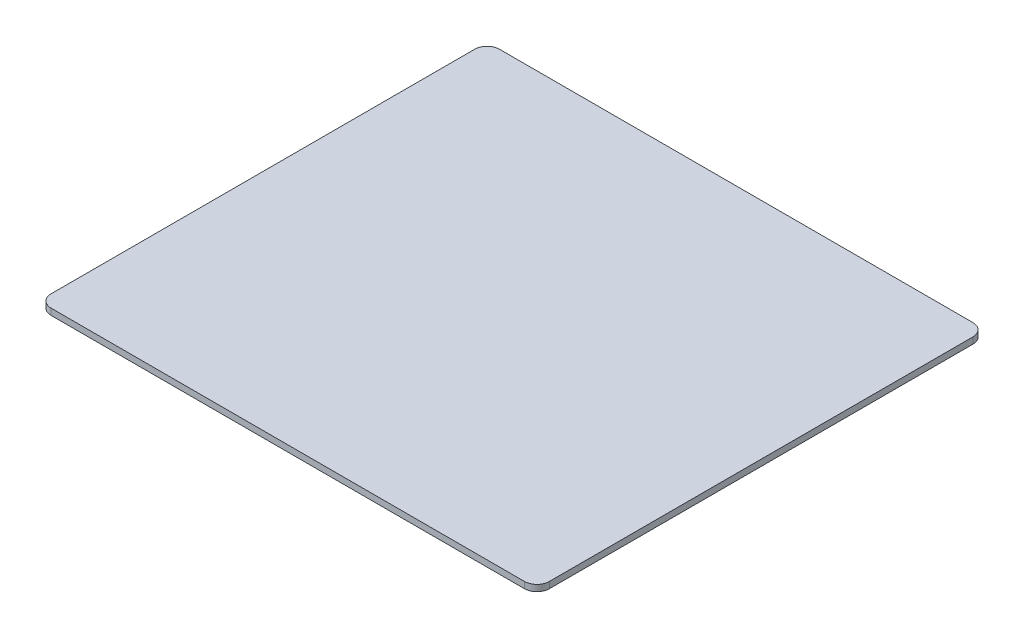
from build123d import *

# Parameters (mm, degrees)
SKETCH1_W           = 20
SKETCH1_H           = 18
BOSS_EXTRUDE1_DEPTH = 0.254
FILLET1_R           = 0.5


with BuildPart() as part:
    # Sketch1 → Boss-Extrude1 (new body)
    with BuildSketch(Plane(origin=(0, 0, 0), x_dir=(1, 0, 0), z_dir=(0, 1, 0))):
        with Locations((-2.226027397, -3.863013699)):
            Rectangle(SKETCH1_W, SKETCH1_H)
    extrude(amount=BOSS_EXTRUDE1_DEPTH)

    # Fillet1
    fillet1_edges = [part.edges().sort_by_distance(p)[0] for p in [
        (-12.226027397, 0.127, -5.136986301),
        (7.773972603, 0.127, -5.136986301),
        (7.773972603, 0.127, 12.863013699),
        (-12.226027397, 0.127, 12.863013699),
    ]]
    fillet(fillet1_edges, radius=FILLET1_R)


solid = part.part
